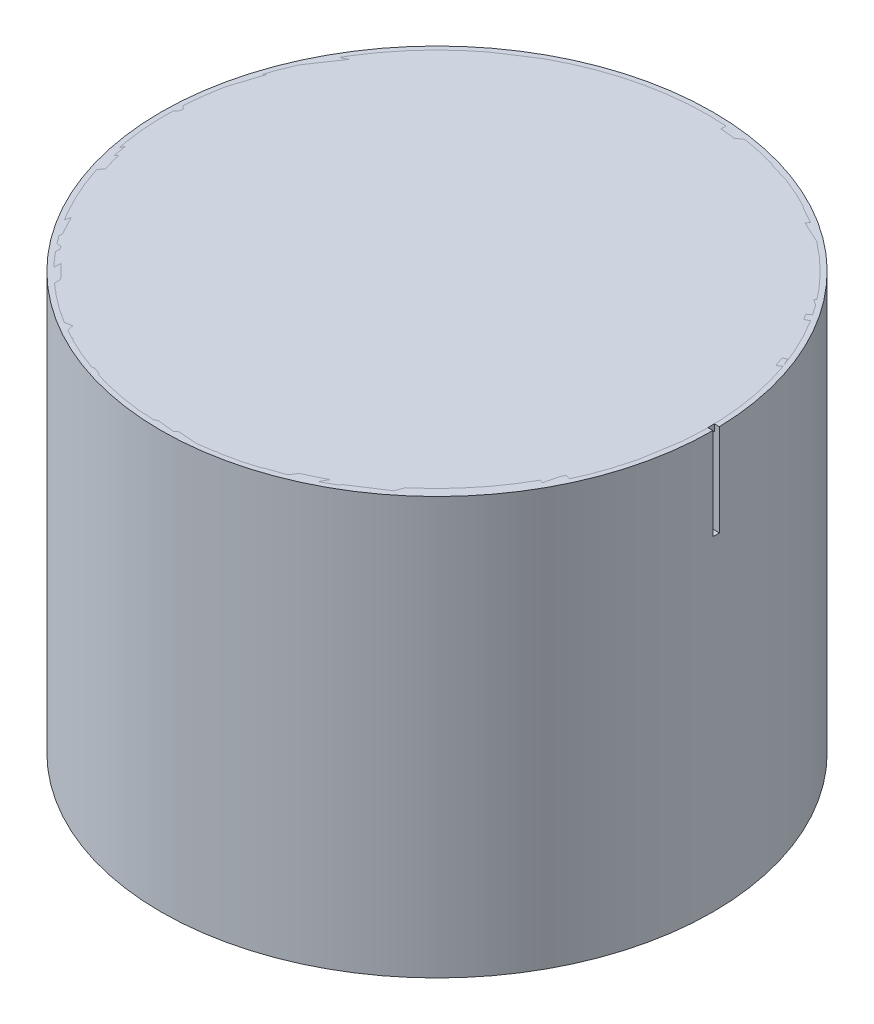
ISO-10303-21;
HEADER;
FILE_DESCRIPTION(('STEP AP214'),'2;1');
FILE_NAME('part.step','',(''),(''),'','','');
FILE_SCHEMA(('AUTOMOTIVE_DESIGN { 1 0 10303 214 1 1 1 1 }'));
ENDSEC;
DATA;
#1=APPLICATION_CONTEXT('core data for automotive mechanical design processes');
#2=APPLICATION_PROTOCOL_DEFINITION('international standard','automotive_design',2000,#1);
#3=PRODUCT_CONTEXT('',#1,'mechanical');
#4=PRODUCT('Part','Part','',(#3));
#5=PRODUCT_RELATED_PRODUCT_CATEGORY('part','',(#4));
#6=PRODUCT_DEFINITION_FORMATION('','',#4);
#7=PRODUCT_DEFINITION_CONTEXT('part definition',#1,'design');
#8=PRODUCT_DEFINITION('design','',#6,#7);
#9=PRODUCT_DEFINITION_SHAPE('','',#8);
#10=(LENGTH_UNIT() NAMED_UNIT(*) SI_UNIT(.MILLI.,.METRE.));
#11=(NAMED_UNIT(*) PLANE_ANGLE_UNIT() SI_UNIT($,.RADIAN.));
#12=(NAMED_UNIT(*) SI_UNIT($,.STERADIAN.) SOLID_ANGLE_UNIT());
#13=UNCERTAINTY_MEASURE_WITH_UNIT(LENGTH_MEASURE(1.E-05),#10,'distance_accuracy_value','');
#14=(GEOMETRIC_REPRESENTATION_CONTEXT(3) GLOBAL_UNCERTAINTY_ASSIGNED_CONTEXT((#13)) GLOBAL_UNIT_ASSIGNED_CONTEXT((#10,
#11,#12)) REPRESENTATION_CONTEXT('',''));
#15=CARTESIAN_POINT('',(0.,0.,0.));
#16=DIRECTION('',(0.,0.,1.));
#17=DIRECTION('',(1.,0.,0.));
#18=AXIS2_PLACEMENT_3D('',#15,#16,#17);
#19=CARTESIAN_POINT('',(0.,7.10000000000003,0.));
#20=DIRECTION('',(0.,1.,0.));
#21=DIRECTION('',(0.,0.,1.));
#22=AXIS2_PLACEMENT_3D('',#19,#20,#21);
#23=CONICAL_SURFACE('',#22,98.1,0.785398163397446);
#24=CARTESIAN_POINT('',(0.,2.90000000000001,0.));
#25=DIRECTION('',(0.,-1.,0.));
#26=DIRECTION('',(0.,0.,-1.));
#27=AXIS2_PLACEMENT_3D('',#24,#25,#26);
#28=CIRCLE('',#27,93.9);
#29=CARTESIAN_POINT('',(0.,2.90000000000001,-93.9));
#30=VERTEX_POINT('',#29);
#31=EDGE_CURVE('E11',#30,#30,#28,.T.);
#32=ORIENTED_EDGE('',*,*,#31,.T.);
#33=EDGE_LOOP('',(#32));
#34=FACE_BOUND('',#33,.T.);
#35=CARTESIAN_POINT('',(0.,7.10000000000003,0.));
#36=DIRECTION('',(0.,-1.,0.));
#37=DIRECTION('',(0.,0.,-1.));
#38=AXIS2_PLACEMENT_3D('',#35,#36,#37);
#39=CIRCLE('',#38,98.1);
#40=CARTESIAN_POINT('',(0.,7.10000000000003,-98.1));
#41=VERTEX_POINT('',#40);
#42=EDGE_CURVE('E65',#41,#41,#39,.T.);
#43=ORIENTED_EDGE('',*,*,#42,.F.);
#44=EDGE_LOOP('',(#43));
#45=FACE_BOUND('',#44,.T.);
#46=ADVANCED_FACE('F51',(#34,#45),#23,.F.);
#47=CARTESIAN_POINT('',(0.,18.4,0.));
#48=DIRECTION('',(0.,-1.,0.));
#49=DIRECTION('',(0.,0.,-1.));
#50=AXIS2_PLACEMENT_3D('',#47,#48,#49);
#51=CYLINDRICAL_SURFACE('',#50,93.9);
#52=CARTESIAN_POINT('',(0.,2.30000000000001,0.));
#53=DIRECTION('',(0.,-1.,0.));
#54=DIRECTION('',(0.,0.,-1.));
#55=AXIS2_PLACEMENT_3D('',#52,#53,#54);
#56=CIRCLE('',#55,93.9);
#57=CARTESIAN_POINT('',(0.,2.30000000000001,-93.9));
#58=VERTEX_POINT('',#57);
#59=EDGE_CURVE('E57',#58,#58,#56,.T.);
#60=ORIENTED_EDGE('',*,*,#59,.T.);
#61=EDGE_LOOP('',(#60));
#62=FACE_BOUND('',#61,.T.);
#63=ORIENTED_EDGE('',*,*,#31,.F.);
#64=EDGE_LOOP('',(#63));
#65=FACE_BOUND('',#64,.T.);
#66=ADVANCED_FACE('F75',(#62,#65),#51,.F.);
#67=CARTESIAN_POINT('',(0.,2.30000000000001,0.));
#68=DIRECTION('',(0.,-1.,0.));
#69=DIRECTION('',(0.,0.,-1.));
#70=AXIS2_PLACEMENT_3D('',#67,#68,#69);
#71=PLANE('',#70);
#72=CARTESIAN_POINT('',(0.,2.30000000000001,0.));
#73=DIRECTION('',(0.,-1.,0.));
#74=DIRECTION('',(0.,0.,-1.));
#75=AXIS2_PLACEMENT_3D('',#72,#73,#74);
#76=CIRCLE('',#75,98.1);
#77=CARTESIAN_POINT('',(0.,2.30000000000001,-98.1));
#78=VERTEX_POINT('',#77);
#79=EDGE_CURVE('E61',#78,#78,#76,.T.);
#80=ORIENTED_EDGE('',*,*,#79,.T.);
#81=EDGE_LOOP('',(#80));
#82=FACE_BOUND('',#81,.T.);
#83=ORIENTED_EDGE('',*,*,#59,.F.);
#84=EDGE_LOOP('',(#83));
#85=FACE_BOUND('',#84,.T.);
#86=ADVANCED_FACE('F79',(#82,#85),#71,.T.);
#87=CARTESIAN_POINT('',(0.,18.4,0.));
#88=DIRECTION('',(0.,-1.,0.));
#89=DIRECTION('',(0.,0.,-1.));
#90=AXIS2_PLACEMENT_3D('',#87,#88,#89);
#91=CYLINDRICAL_SURFACE('',#90,98.1);
#92=ORIENTED_EDGE('',*,*,#42,.T.);
#93=EDGE_LOOP('',(#92));
#94=FACE_BOUND('',#93,.T.);
#95=ORIENTED_EDGE('',*,*,#79,.F.);
#96=EDGE_LOOP('',(#95));
#97=FACE_BOUND('',#96,.T.);
#98=ADVANCED_FACE('F71',(#94,#97),#91,.T.);
#99=CLOSED_SHELL('',(#46,#66,#86,#98));
#100=MANIFOLD_SOLID_BREP('B2_NOT_SHOWN',#99);
#101=CARTESIAN_POINT('',(0.,2.4,0.));
#102=DIRECTION('',(0.,1.,0.));
#103=DIRECTION('',(-1.,0.,0.));
#104=AXIS2_PLACEMENT_3D('',#101,#102,#103);
#105=CYLINDRICAL_SURFACE('',#104,97.5);
#106=CARTESIAN_POINT('',(0.,2.40000000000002,0.));
#107=DIRECTION('',(0.,1.,0.));
#108=DIRECTION('',(-1.,0.,0.));
#109=AXIS2_PLACEMENT_3D('',#106,#107,#108);
#110=CIRCLE('',#109,97.5);
#111=CARTESIAN_POINT('',(-97.5,2.40000000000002,0.));
#112=VERTEX_POINT('',#111);
#113=EDGE_CURVE('E50',#112,#112,#110,.T.);
#114=ORIENTED_EDGE('',*,*,#113,.F.);
#115=EDGE_LOOP('',(#114));
#116=FACE_BOUND('',#115,.T.);
#117=CARTESIAN_POINT('',(0.,0.,0.));
#118=DIRECTION('',(0.,1.,0.));
#119=DIRECTION('',(-1.,0.,0.));
#120=AXIS2_PLACEMENT_3D('',#117,#118,#119);
#121=CIRCLE('',#120,97.5);
#122=CARTESIAN_POINT('',(-97.5,0.,0.));
#123=VERTEX_POINT('',#122);
#124=EDGE_CURVE('E126',#123,#123,#121,.T.);
#125=ORIENTED_EDGE('',*,*,#124,.T.);
#126=EDGE_LOOP('',(#125));
#127=FACE_BOUND('',#126,.T.);
#128=ADVANCED_FACE('F120',(#116,#127),#105,.T.);
#129=CARTESIAN_POINT('',(0.,2.40000000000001,0.));
#130=DIRECTION('',(0.,-1.,0.));
#131=DIRECTION('',(1.,0.,0.));
#132=AXIS2_PLACEMENT_3D('',#129,#130,#131);
#133=PLANE('',#132);
#134=ORIENTED_EDGE('',*,*,#113,.T.);
#135=EDGE_LOOP('',(#134));
#136=FACE_BOUND('',#135,.T.);
#137=ADVANCED_FACE('F135',(#136),#133,.F.);
#138=CARTESIAN_POINT('',(0.,0.,0.));
#139=DIRECTION('',(0.,1.,0.));
#140=DIRECTION('',(-1.,0.,0.));
#141=AXIS2_PLACEMENT_3D('',#138,#139,#140);
#142=PLANE('',#141);
#143=ORIENTED_EDGE('',*,*,#124,.F.);
#144=EDGE_LOOP('',(#143));
#145=FACE_BOUND('',#144,.T.);
#146=ADVANCED_FACE('F133',(#145),#142,.F.);
#147=CLOSED_SHELL('',(#128,#137,#146));
#148=MANIFOLD_SOLID_BREP('B6_NOT_SHOWN',#147);
#149=CARTESIAN_POINT('',(0.,39.6,0.));
#150=DIRECTION('',(0.,-1.,0.));
#151=DIRECTION('',(0.,0.,-1.));
#152=AXIS2_PLACEMENT_3D('',#149,#150,#151);
#153=PLANE('',#152);
#154=CARTESIAN_POINT('',(0.,39.6,0.));
#155=DIRECTION('',(0.,-1.,0.));
#156=DIRECTION('',(0.,0.,-1.));
#157=AXIS2_PLACEMENT_3D('',#154,#155,#156);
#158=CIRCLE('',#157,32.);
#159=CARTESIAN_POINT('',(0.,39.6,-32.));
#160=VERTEX_POINT('',#159);
#161=EDGE_CURVE('E119',#160,#160,#158,.T.);
#162=ORIENTED_EDGE('',*,*,#161,.T.);
#163=EDGE_LOOP('',(#162));
#164=FACE_BOUND('',#163,.T.);
#165=ADVANCED_FACE('F174',(#164),#153,.T.);
#166=CARTESIAN_POINT('',(0.,18.4,0.));
#167=DIRECTION('',(0.,-1.,0.));
#168=DIRECTION('',(0.,0.,-1.));
#169=AXIS2_PLACEMENT_3D('',#166,#167,#168);
#170=CYLINDRICAL_SURFACE('',#169,32.);
#171=CARTESIAN_POINT('',(0.,38.4,0.));
#172=DIRECTION('',(0.,-1.,0.));
#173=DIRECTION('',(0.,0.,-1.));
#174=AXIS2_PLACEMENT_3D('',#171,#172,#173);
#175=CIRCLE('',#174,32.);
#176=CARTESIAN_POINT('',(0.,38.4,-32.));
#177=VERTEX_POINT('',#176);
#178=EDGE_CURVE('E180',#177,#177,#175,.T.);
#179=ORIENTED_EDGE('',*,*,#178,.T.);
#180=EDGE_LOOP('',(#179));
#181=FACE_BOUND('',#180,.T.);
#182=ORIENTED_EDGE('',*,*,#161,.F.);
#183=EDGE_LOOP('',(#182));
#184=FACE_BOUND('',#183,.T.);
#185=ADVANCED_FACE('F206',(#181,#184),#170,.F.);
#186=CARTESIAN_POINT('',(0.,38.4,0.));
#187=DIRECTION('',(0.,-1.,0.));
#188=DIRECTION('',(0.,0.,-1.));
#189=AXIS2_PLACEMENT_3D('',#186,#187,#188);
#190=PLANE('',#189);
#191=CARTESIAN_POINT('',(0.,38.4,0.));
#192=DIRECTION('',(0.,-1.,0.));
#193=DIRECTION('',(0.,0.,-1.));
#194=AXIS2_PLACEMENT_3D('',#191,#192,#193);
#195=CIRCLE('',#194,99.3);
#196=CARTESIAN_POINT('',(0.,38.4,-99.3));
#197=VERTEX_POINT('',#196);
#198=EDGE_CURVE('E184',#197,#197,#195,.T.);
#199=ORIENTED_EDGE('',*,*,#198,.T.);
#200=EDGE_LOOP('',(#199));
#201=FACE_BOUND('',#200,.T.);
#202=ORIENTED_EDGE('',*,*,#178,.F.);
#203=EDGE_LOOP('',(#202));
#204=FACE_BOUND('',#203,.T.);
#205=ADVANCED_FACE('F202',(#201,#204),#190,.T.);
#206=CARTESIAN_POINT('',(0.,18.4,0.));
#207=DIRECTION('',(0.,-1.,0.));
#208=DIRECTION('',(0.,0.,-1.));
#209=AXIS2_PLACEMENT_3D('',#206,#207,#208);
#210=CYLINDRICAL_SURFACE('',#209,99.3);
#211=ORIENTED_EDGE('',*,*,#198,.F.);
#212=EDGE_LOOP('',(#211));
#213=FACE_BOUND('',#212,.T.);
#214=CARTESIAN_POINT('',(0.,40.8,0.));
#215=DIRECTION('',(0.,-1.,0.));
#216=DIRECTION('',(0.,0.,-1.));
#217=AXIS2_PLACEMENT_3D('',#214,#215,#216);
#218=CIRCLE('',#217,99.3);
#219=CARTESIAN_POINT('',(0.,40.8,-99.3));
#220=VERTEX_POINT('',#219);
#221=EDGE_CURVE('E188',#220,#220,#218,.T.);
#222=ORIENTED_EDGE('',*,*,#221,.T.);
#223=EDGE_LOOP('',(#222));
#224=FACE_BOUND('',#223,.T.);
#225=ADVANCED_FACE('F194',(#213,#224),#210,.T.);
#226=CARTESIAN_POINT('',(0.,40.8,0.));
#227=DIRECTION('',(0.,1.,0.));
#228=DIRECTION('',(0.,0.,1.));
#229=AXIS2_PLACEMENT_3D('',#226,#227,#228);
#230=PLANE('',#229);
#231=ORIENTED_EDGE('',*,*,#221,.F.);
#232=EDGE_LOOP('',(#231));
#233=FACE_BOUND('',#232,.T.);
#234=ADVANCED_FACE('F196',(#233),#230,.T.);
#235=CLOSED_SHELL('',(#165,#185,#205,#225,#234));
#236=MANIFOLD_SOLID_BREP('B45_NOT_SHOWN',#235);
#237=CARTESIAN_POINT('',(0.,40.8,0.));
#238=DIRECTION('',(0.,1.,0.));
#239=DIRECTION('',(-1.,0.,0.));
#240=AXIS2_PLACEMENT_3D('',#237,#238,#239);
#241=CYLINDRICAL_SURFACE('',#240,32.);
#242=CARTESIAN_POINT('',(0.,38.4,0.));
#243=DIRECTION('',(0.,1.,0.));
#244=DIRECTION('',(-1.,0.,0.));
#245=AXIS2_PLACEMENT_3D('',#242,#243,#244);
#246=CIRCLE('',#245,32.);
#247=CARTESIAN_POINT('',(-32.,38.4,0.));
#248=VERTEX_POINT('',#247);
#249=EDGE_CURVE('E262',#248,#248,#246,.T.);
#250=ORIENTED_EDGE('',*,*,#249,.T.);
#251=EDGE_LOOP('',(#250));
#252=FACE_BOUND('',#251,.T.);
#253=CARTESIAN_POINT('',(0.,39.6,0.));
#254=DIRECTION('',(0.,1.,0.));
#255=DIRECTION('',(-1.,0.,0.));
#256=AXIS2_PLACEMENT_3D('',#253,#254,#255);
#257=CIRCLE('',#256,32.);
#258=CARTESIAN_POINT('',(-32.,39.6,0.));
#259=VERTEX_POINT('',#258);
#260=EDGE_CURVE('E173',#259,#259,#257,.T.);
#261=ORIENTED_EDGE('',*,*,#260,.F.);
#262=EDGE_LOOP('',(#261));
#263=FACE_BOUND('',#262,.T.);
#264=ADVANCED_FACE('F256',(#252,#263),#241,.T.);
#265=CARTESIAN_POINT('',(0.,39.6,0.));
#266=DIRECTION('',(0.,1.,0.));
#267=DIRECTION('',(-1.,0.,0.));
#268=AXIS2_PLACEMENT_3D('',#265,#266,#267);
#269=PLANE('',#268);
#270=ORIENTED_EDGE('',*,*,#260,.T.);
#271=EDGE_LOOP('',(#270));
#272=FACE_BOUND('',#271,.T.);
#273=ADVANCED_FACE('F272',(#272),#269,.T.);
#274=CARTESIAN_POINT('',(0.,38.4,0.));
#275=DIRECTION('',(0.,1.,0.));
#276=DIRECTION('',(-1.,0.,0.));
#277=AXIS2_PLACEMENT_3D('',#274,#275,#276);
#278=PLANE('',#277);
#279=ORIENTED_EDGE('',*,*,#249,.F.);
#280=EDGE_LOOP('',(#279));
#281=FACE_BOUND('',#280,.T.);
#282=ADVANCED_FACE('F270',(#281),#278,.F.);
#283=CLOSED_SHELL('',(#264,#273,#282));
#284=MANIFOLD_SOLID_BREP('B114_NOT_SHOWN',#283);
#285=CARTESIAN_POINT('',(0.,40.8,0.));
#286=DIRECTION('',(0.,1.,0.));
#287=DIRECTION('',(0.,0.,1.));
#288=AXIS2_PLACEMENT_3D('',#285,#286,#287);
#289=PLANE('',#288);
#290=CARTESIAN_POINT('',(0.,40.8,0.));
#291=DIRECTION('',(0.,-1.,0.));
#292=DIRECTION('',(0.,0.,-1.));
#293=AXIS2_PLACEMENT_3D('',#290,#291,#292);
#294=CIRCLE('',#293,97.5);
#295=CARTESIAN_POINT('',(97.5,40.8,0.));
#296=VERTEX_POINT('',#295);
#297=CARTESIAN_POINT('',(97.4704570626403,40.8,-2.4));
#298=VERTEX_POINT('',#297);
#299=EDGE_CURVE('E254',#296,#298,#294,.T.);
#300=ORIENTED_EDGE('',*,*,#299,.T.);
#301=DIRECTION('',(1.,0.,0.));
#302=VECTOR('',#301,1.);
#303=CARTESIAN_POINT('',(0.,40.8,-2.4));
#304=LINE('',#303,#302);
#305=CARTESIAN_POINT('',(101.071509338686,40.8,-2.4));
#306=VERTEX_POINT('',#305);
#307=EDGE_CURVE('E335',#298,#306,#304,.T.);
#308=ORIENTED_EDGE('',*,*,#307,.T.);
#309=CARTESIAN_POINT('',(0.,40.8,0.));
#310=DIRECTION('',(0.,-1.,0.));
#311=DIRECTION('',(0.,0.,-1.));
#312=AXIS2_PLACEMENT_3D('',#309,#310,#311);
#313=CIRCLE('',#312,101.1);
#314=CARTESIAN_POINT('',(101.1,40.8,0.));
#315=VERTEX_POINT('',#314);
#316=EDGE_CURVE('E360',#315,#306,#313,.T.);
#317=ORIENTED_EDGE('',*,*,#316,.F.);
#318=DIRECTION('',(1.,0.,0.));
#319=VECTOR('',#318,1.);
#320=CARTESIAN_POINT('',(0.,40.8,0.));
#321=LINE('',#320,#319);
#322=EDGE_CURVE('E388',#296,#315,#321,.T.);
#323=ORIENTED_EDGE('',*,*,#322,.F.);
#324=EDGE_LOOP('',(#300,#308,#317,#323));
#325=FACE_BOUND('',#324,.T.);
#326=ADVANCED_FACE('F296',(#325),#289,.T.);
#327=CARTESIAN_POINT('',(0.,18.4,0.));
#328=DIRECTION('',(0.,-1.,0.));
#329=DIRECTION('',(0.,0.,-1.));
#330=AXIS2_PLACEMENT_3D('',#327,#328,#329);
#331=CYLINDRICAL_SURFACE('',#330,97.5);
#332=CARTESIAN_POINT('',(0.,-112.,0.));
#333=DIRECTION('',(0.,-1.,0.));
#334=DIRECTION('',(0.,0.,-1.));
#335=AXIS2_PLACEMENT_3D('',#332,#333,#334);
#336=CIRCLE('',#335,97.5);
#337=CARTESIAN_POINT('',(0.,-112.,-97.5));
#338=VERTEX_POINT('',#337);
#339=EDGE_CURVE('E303',#338,#338,#336,.T.);
#340=ORIENTED_EDGE('',*,*,#339,.T.);
#341=EDGE_LOOP('',(#340));
#342=FACE_BOUND('',#341,.T.);
#343=DIRECTION('',(0.,1.,0.));
#344=VECTOR('',#343,1.);
#345=CARTESIAN_POINT('',(97.4704570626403,7.10000000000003,-2.4));
#346=LINE('',#345,#344);
#347=CARTESIAN_POINT('',(97.4704570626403,7.10000000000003,-2.4));
#348=VERTEX_POINT('',#347);
#349=EDGE_CURVE('E319',#348,#298,#346,.T.);
#350=ORIENTED_EDGE('',*,*,#349,.T.);
#351=ORIENTED_EDGE('',*,*,#299,.F.);
#352=DIRECTION('',(0.,1.,0.));
#353=VECTOR('',#352,1.);
#354=CARTESIAN_POINT('',(97.5,7.10000000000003,0.));
#355=LINE('',#354,#353);
#356=CARTESIAN_POINT('',(97.5,7.10000000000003,0.));
#357=VERTEX_POINT('',#356);
#358=EDGE_CURVE('E339',#357,#296,#355,.T.);
#359=ORIENTED_EDGE('',*,*,#358,.F.);
#360=CARTESIAN_POINT('',(0.,7.10000000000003,0.));
#361=DIRECTION('',(0.,1.,0.));
#362=DIRECTION('',(0.,0.,1.));
#363=AXIS2_PLACEMENT_3D('',#360,#361,#362);
#364=CIRCLE('',#363,97.5);
#365=EDGE_CURVE('E345',#348,#357,#364,.F.);
#366=ORIENTED_EDGE('',*,*,#365,.F.);
#367=EDGE_LOOP('',(#350,#351,#359,#366));
#368=FACE_BOUND('',#367,.T.);
#369=ADVANCED_FACE('F353',(#342,#368),#331,.F.);
#370=CARTESIAN_POINT('',(0.,18.4,0.));
#371=DIRECTION('',(0.,-1.,0.));
#372=DIRECTION('',(0.,0.,-1.));
#373=AXIS2_PLACEMENT_3D('',#370,#371,#372);
#374=CYLINDRICAL_SURFACE('',#373,101.1);
#375=CARTESIAN_POINT('',(0.,-112.,0.));
#376=DIRECTION('',(0.,-1.,0.));
#377=DIRECTION('',(0.,0.,-1.));
#378=AXIS2_PLACEMENT_3D('',#375,#376,#377);
#379=CIRCLE('',#378,101.1);
#380=CARTESIAN_POINT('',(0.,-112.,-101.1));
#381=VERTEX_POINT('',#380);
#382=EDGE_CURVE('E363',#381,#381,#379,.T.);
#383=ORIENTED_EDGE('',*,*,#382,.F.);
#384=EDGE_LOOP('',(#383));
#385=FACE_BOUND('',#384,.T.);
#386=ORIENTED_EDGE('',*,*,#316,.T.);
#387=DIRECTION('',(0.,1.,0.));
#388=VECTOR('',#387,1.);
#389=CARTESIAN_POINT('',(101.071509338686,7.10000000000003,-2.4));
#390=LINE('',#389,#388);
#391=CARTESIAN_POINT('',(101.071509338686,7.10000000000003,-2.4));
#392=VERTEX_POINT('',#391);
#393=EDGE_CURVE('E355',#392,#306,#390,.T.);
#394=ORIENTED_EDGE('',*,*,#393,.F.);
#395=CARTESIAN_POINT('',(0.,7.10000000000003,0.));
#396=DIRECTION('',(0.,1.,0.));
#397=DIRECTION('',(0.,0.,1.));
#398=AXIS2_PLACEMENT_3D('',#395,#396,#397);
#399=CIRCLE('',#398,101.1);
#400=CARTESIAN_POINT('',(101.1,7.10000000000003,0.));
#401=VERTEX_POINT('',#400);
#402=EDGE_CURVE('E344',#401,#392,#399,.T.);
#403=ORIENTED_EDGE('',*,*,#402,.F.);
#404=DIRECTION('',(0.,1.,0.));
#405=VECTOR('',#404,1.);
#406=CARTESIAN_POINT('',(101.1,7.10000000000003,0.));
#407=LINE('',#406,#405);
#408=EDGE_CURVE('E342',#401,#315,#407,.T.);
#409=ORIENTED_EDGE('',*,*,#408,.T.);
#410=EDGE_LOOP('',(#386,#394,#403,#409));
#411=FACE_BOUND('',#410,.T.);
#412=ADVANCED_FACE('F372',(#385,#411),#374,.T.);
#413=CARTESIAN_POINT('',(4.31753398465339E-13,-112.,0.));
#414=DIRECTION('',(0.,-1.,0.));
#415=DIRECTION('',(0.,0.,-1.));
#416=AXIS2_PLACEMENT_3D('',#413,#414,#415);
#417=PLANE('',#416);
#418=ORIENTED_EDGE('',*,*,#382,.T.);
#419=EDGE_LOOP('',(#418));
#420=FACE_BOUND('',#419,.T.);
#421=ORIENTED_EDGE('',*,*,#339,.F.);
#422=EDGE_LOOP('',(#421));
#423=FACE_BOUND('',#422,.T.);
#424=ADVANCED_FACE('F369',(#420,#423),#417,.T.);
#425=CARTESIAN_POINT('',(0.,7.10000000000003,-2.4));
#426=DIRECTION('',(0.,0.,1.));
#427=DIRECTION('',(1.,0.,0.));
#428=AXIS2_PLACEMENT_3D('',#425,#426,#427);
#429=PLANE('',#428);
#430=ORIENTED_EDGE('',*,*,#307,.F.);
#431=ORIENTED_EDGE('',*,*,#349,.F.);
#432=DIRECTION('',(1.,0.,0.));
#433=VECTOR('',#432,1.);
#434=CARTESIAN_POINT('',(0.,7.10000000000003,-2.4));
#435=LINE('',#434,#433);
#436=EDGE_CURVE('E349',#348,#392,#435,.T.);
#437=ORIENTED_EDGE('',*,*,#436,.T.);
#438=ORIENTED_EDGE('',*,*,#393,.T.);
#439=EDGE_LOOP('',(#430,#431,#437,#438));
#440=FACE_BOUND('',#439,.T.);
#441=ADVANCED_FACE('F371',(#440),#429,.T.);
#442=CARTESIAN_POINT('',(0.,7.10000000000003,0.));
#443=DIRECTION('',(0.,0.,1.));
#444=DIRECTION('',(1.,0.,0.));
#445=AXIS2_PLACEMENT_3D('',#442,#443,#444);
#446=PLANE('',#445);
#447=ORIENTED_EDGE('',*,*,#322,.T.);
#448=ORIENTED_EDGE('',*,*,#408,.F.);
#449=DIRECTION('',(1.,0.,0.));
#450=VECTOR('',#449,1.);
#451=CARTESIAN_POINT('',(0.,7.10000000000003,0.));
#452=LINE('',#451,#450);
#453=EDGE_CURVE('E310',#357,#401,#452,.T.);
#454=ORIENTED_EDGE('',*,*,#453,.F.);
#455=ORIENTED_EDGE('',*,*,#358,.T.);
#456=EDGE_LOOP('',(#447,#448,#454,#455));
#457=FACE_BOUND('',#456,.T.);
#458=ADVANCED_FACE('F337',(#457),#446,.F.);
#459=CARTESIAN_POINT('',(0.,7.10000000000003,0.));
#460=DIRECTION('',(0.,1.,0.));
#461=DIRECTION('',(0.,0.,1.));
#462=AXIS2_PLACEMENT_3D('',#459,#460,#461);
#463=PLANE('',#462);
#464=ORIENTED_EDGE('',*,*,#365,.T.);
#465=ORIENTED_EDGE('',*,*,#453,.T.);
#466=ORIENTED_EDGE('',*,*,#402,.T.);
#467=ORIENTED_EDGE('',*,*,#436,.F.);
#468=EDGE_LOOP('',(#464,#465,#466,#467));
#469=FACE_BOUND('',#468,.T.);
#470=ADVANCED_FACE('F348',(#469),#463,.T.);
#471=CLOSED_SHELL('',(#326,#369,#412,#424,#441,#458,#470));
#472=MANIFOLD_SOLID_BREP('B168',#471);
#473=ADVANCED_BREP_SHAPE_REPRESENTATION('',(#18,#100,#148,#236,#284,#472),#14);
#474=SHAPE_DEFINITION_REPRESENTATION(#9,#473);
ENDSEC;
END-ISO-10303-21;
